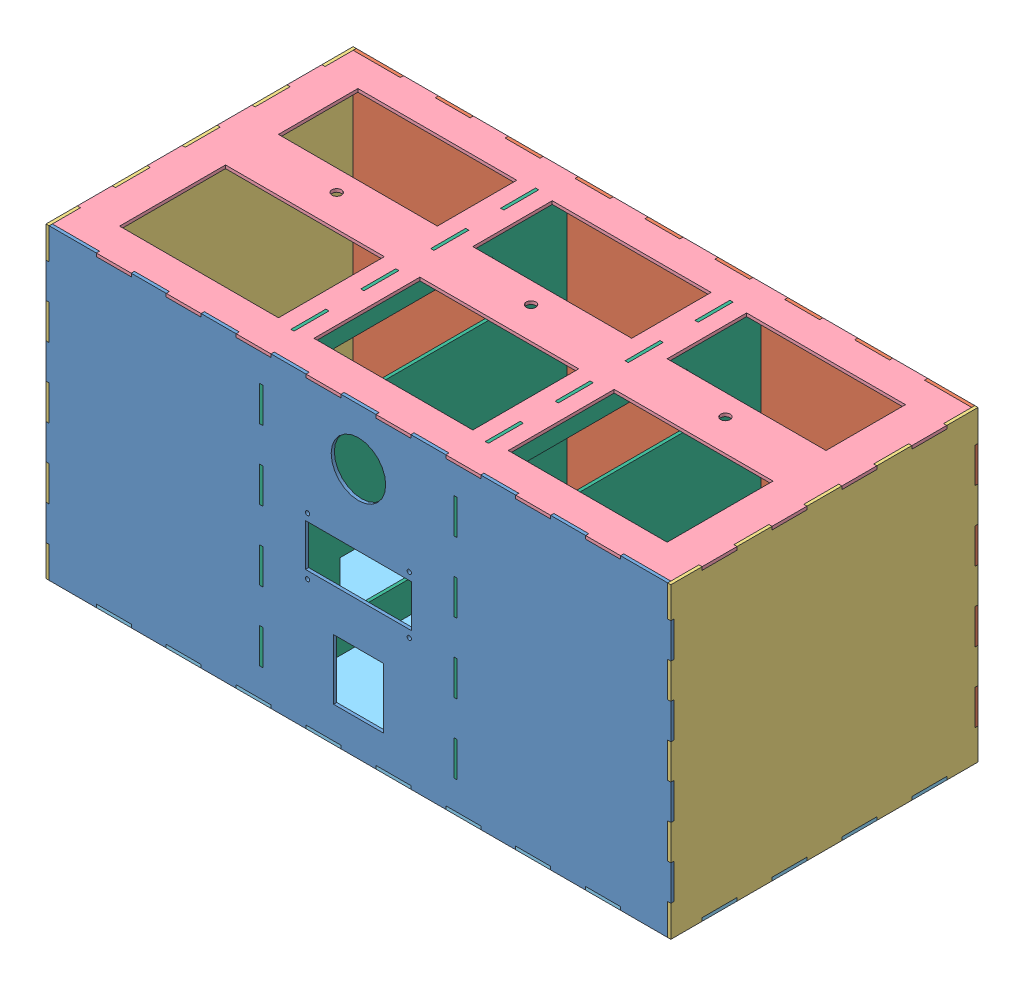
SolidWorks assembly Assem.SLDASM, configuration Default (file format 14000). Lengths in mm.
Overall size (590 290 290).
8 component instances, 6 part files, 22 mates.
Components (placement in the parent):
- front_karton-1: front_karton.SLDPRT [Default] at (-339.9792 -139.3336 440.9424) size (590 290 3)
- back_karton-1: back_karton.SLDPRT [Default] at (-339.9792 -139.3336 153.9424) size (590 290 3)
- side_karton-1: side_karton.SLDPRT [Default] at (543.0208 153.6664 153.9424) x (0 0 1) z (-1 0 0) size (290 290 3)
- side_karton-2: side_karton.SLDPRT [Default] at (-43.9792 153.6664 153.9424) x (0 0 1) z (-1 0 0) size (290 290 3)
- top_karton-1: top_karton.SLDPRT [Default] at (-49.9792 443.6664 -732.0576) x (0 0 1) z (-1 0 0) size (290 3 590)
- bottom_karton-1: bottom_karton.SLDPRT [Default] at (-49.9792 159.6664 1329.9424) x (0 0 -1) z (-1 0 0) size (290 3 590)
- tussenstuk_karton-1: tussenstuk_karton.SLDPRT [Default] at (157.7708 159.6664 440.9424) x (0 0 1) z (-1 0 0) size (290 290 3)
- tussenstuk_karton-2: tussenstuk_karton.SLDPRT [Default] at (341.2708 159.6664 440.9424) x (0 0 1) z (-1 0 0) size (290 290 3)
Mates (geometry in assembly coordinates):
- Coincident11: coincident anti-aligned: line of front_karton-1 through (0.5208 446.6664 440.9424) axis (-1 0 0); line of top_karton-1 through (-43.9792 446.6664 440.9424) axis (1 0 0)
- Coincident12: coincident anti-aligned: plane of front_karton-1 through (0.5208 443.6664 443.9424) normal (1 0 0); plane of top_karton-1 through (0.5208 446.6664 440.9424) normal (-1 0 0)
- Coincident14: coincident anti-aligned: line of front_karton-1 through (33.5208 443.6664 443.9424) axis (-1 0 0); line of top_karton-1 through (0.5208 443.6664 443.9424) axis (1 0 0)
- Coincident17: coincident anti-aligned: plane of side_karton-1 through (540.0208 443.6664 183.4424) normal (0 0 1); plane of top_karton-1 through (543.0208 446.6664 183.4424) normal (0 0 -1)
- Coincident18: coincident aligned: line of side_karton-1 through (540.0208 446.6664 249.4424) axis (0 0 -1); line of top_karton-1 through (540.0208 446.6664 249.4424) axis (0 0 -1)
- Coincident19: coincident anti-aligned: line of side_karton-1 through (540.0208 446.6664 249.4424) axis (1 0 0); line of top_karton-1 through (543.0208 446.6664 249.4424) axis (-1 0 0)
- Coincident20: coincident anti-aligned: plane of side_karton-2 through (-46.9792 446.6664 414.4424) normal (0 0 -1); plane of top_karton-1 through (-46.9792 446.6664 414.4424) normal (0 0 1)
- Coincident21: coincident anti-aligned: line of side_karton-2 through (-43.9792 446.6664 443.9424) axis (0 0 -1); line of top_karton-1 through (-43.9792 446.6664 414.4424) axis (0 0 1)
- Coincident22: coincident aligned: line of side_karton-2 through (-46.9792 446.6664 414.4424) axis (1 0 0); line of top_karton-1 through (-46.9792 446.6664 414.4424) axis (1 0 0)
- Coincident23: coincident anti-aligned: line of side_karton-2 through (-43.9792 156.6664 153.9424) axis (0 0 1); line of bottom_karton-1 through (-43.9792 156.6664 183.4424) axis (0 0 -1)
- Parallel3: parallel aligned: line of side_karton-1 through (540.0208 156.6664 153.9424) axis (0 0 1); line of bottom_karton-1 through (540.0208 159.6664 156.9424) axis (0 0 1)
- Parallel4: parallel aligned: line of side_karton-1 through (540.0208 159.6664 183.4424) axis (0 0 1); line of bottom_karton-1 through (543.0208 159.6664 183.4424) axis (0 0 1)
- Coincident26: coincident anti-aligned: plane of side_karton-1 through (540.0208 159.6664 216.4424) normal (0 0 -1); plane of bottom_karton-1 through (543.0208 156.6664 216.4424) normal (0 0 1)
- Coincident27: coincident anti-aligned: plane of side_karton-1 through (540.0208 159.6664 249.4424) normal (0 -1 0); plane of bottom_karton-1 through (-49.9792 159.6664 1329.9424) normal (0 1 0)
- Coincident28: coincident aligned: line of back_karton-1 through (0.5208 446.6664 156.9424) axis (-1 0 0); line of top_karton-1 through (0.5208 446.6664 156.9424) axis (-1 0 0)
- Coincident29: coincident anti-aligned: plane of back_karton-1 through (-43.9792 384.1664 156.9424) normal (-1 0 0); plane of side_karton-2 through (-43.9792 153.6664 153.9424) normal (1 0 0)
- Coincident30: coincident aligned: line of back_karton-1 through (-43.9792 156.6664 156.9424) axis (1 0 0); line of bottom_karton-1 through (-43.9792 156.6664 156.9424) axis (1 0 0)
- Coincident31: coincident anti-aligned: line of bottom_karton-1 through (154.7708 156.6664 414.4424) axis (0 0 -1); line of tussenstuk_karton-1 through (154.7708 156.6664 381.4424) axis (0 0 1)
- Coincident32: coincident anti-aligned: plane of bottom_karton-1 through (157.7708 156.6664 381.4424) normal (0 0 1); plane of tussenstuk_karton-1 through (154.7708 159.6664 381.4424) normal (0 0 -1)
- Coincident33: coincident anti-aligned: line of top_karton-1 through (154.7708 446.6664 183.4424) axis (0 0 1); line of tussenstuk_karton-1 through (154.7708 446.6664 216.4424) axis (0 0 -1)
- Coincident34: coincident anti-aligned: line of bottom_karton-1 through (338.2708 156.6664 414.4424) axis (0 0 -1); line of tussenstuk_karton-2 through (338.2708 156.6664 381.4424) axis (0 0 1)
- Coincident35: coincident anti-aligned: plane of bottom_karton-1 through (341.2708 156.6664 381.4424) normal (0 0 1); plane of tussenstuk_karton-2 through (338.2708 159.6664 381.4424) normal (0 0 -1)
